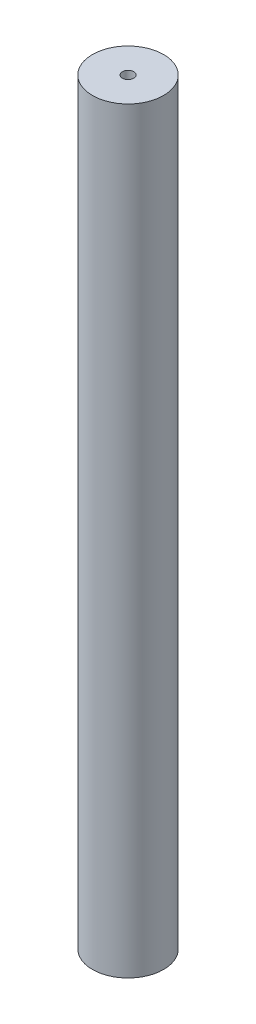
ISO-10303-21;
HEADER;
FILE_DESCRIPTION(('STEP AP214'),'2;1');
FILE_NAME('part.step','',(''),(''),'','','');
FILE_SCHEMA(('AUTOMOTIVE_DESIGN { 1 0 10303 214 1 1 1 1 }'));
ENDSEC;
DATA;
#1=APPLICATION_CONTEXT('core data for automotive mechanical design processes');
#2=APPLICATION_PROTOCOL_DEFINITION('international standard','automotive_design',2000,#1);
#3=PRODUCT_CONTEXT('',#1,'mechanical');
#4=PRODUCT('Part','Part','',(#3));
#5=PRODUCT_RELATED_PRODUCT_CATEGORY('part','',(#4));
#6=PRODUCT_DEFINITION_FORMATION('','',#4);
#7=PRODUCT_DEFINITION_CONTEXT('part definition',#1,'design');
#8=PRODUCT_DEFINITION('design','',#6,#7);
#9=PRODUCT_DEFINITION_SHAPE('','',#8);
#10=(LENGTH_UNIT() NAMED_UNIT(*) SI_UNIT(.MILLI.,.METRE.));
#11=(NAMED_UNIT(*) PLANE_ANGLE_UNIT() SI_UNIT($,.RADIAN.));
#12=(NAMED_UNIT(*) SI_UNIT($,.STERADIAN.) SOLID_ANGLE_UNIT());
#13=UNCERTAINTY_MEASURE_WITH_UNIT(LENGTH_MEASURE(1.E-05),#10,'distance_accuracy_value','');
#14=(GEOMETRIC_REPRESENTATION_CONTEXT(3) GLOBAL_UNCERTAINTY_ASSIGNED_CONTEXT((#13)) GLOBAL_UNIT_ASSIGNED_CONTEXT((#10,
#11,#12)) REPRESENTATION_CONTEXT('',''));
#15=CARTESIAN_POINT('',(0.,0.,0.));
#16=DIRECTION('',(0.,0.,1.));
#17=DIRECTION('',(1.,0.,0.));
#18=AXIS2_PLACEMENT_3D('',#15,#16,#17);
#19=CARTESIAN_POINT('',(175.,7.,0.));
#20=DIRECTION('',(0.,1.,0.));
#21=DIRECTION('',(0.,0.,1.));
#22=AXIS2_PLACEMENT_3D('',#19,#20,#21);
#23=PLANE('',#22);
#24=CARTESIAN_POINT('',(175.,7.,0.));
#25=DIRECTION('',(0.,1.,0.));
#26=DIRECTION('',(0.,0.,1.));
#27=AXIS2_PLACEMENT_3D('',#24,#25,#26);
#28=CIRCLE('',#27,1.59999999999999);
#29=CARTESIAN_POINT('',(175.,7.,1.59999999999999));
#30=VERTEX_POINT('',#29);
#31=EDGE_CURVE('E54',#30,#30,#28,.T.);
#32=ORIENTED_EDGE('',*,*,#31,.T.);
#33=EDGE_LOOP('',(#32));
#34=FACE_BOUND('',#33,.T.);
#35=CARTESIAN_POINT('',(175.,7.00000000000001,0.));
#36=DIRECTION('',(0.,1.,0.));
#37=DIRECTION('',(0.,0.,1.));
#38=AXIS2_PLACEMENT_3D('',#35,#36,#37);
#39=CIRCLE('',#38,10.);
#40=CARTESIAN_POINT('',(175.,7.00000000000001,10.));
#41=VERTEX_POINT('',#40);
#42=EDGE_CURVE('E43',#41,#41,#39,.T.);
#43=ORIENTED_EDGE('',*,*,#42,.F.);
#44=EDGE_LOOP('',(#43));
#45=FACE_BOUND('',#44,.T.);
#46=ADVANCED_FACE('F35',(#34,#45),#23,.F.);
#47=CARTESIAN_POINT('',(175.,248.284271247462,0.));
#48=DIRECTION('',(0.,-1.,0.));
#49=DIRECTION('',(0.,0.,-1.));
#50=AXIS2_PLACEMENT_3D('',#47,#48,#49);
#51=CYLINDRICAL_SURFACE('',#50,10.);
#52=CARTESIAN_POINT('',(175.,220.,0.));
#53=DIRECTION('',(0.,-1.,0.));
#54=DIRECTION('',(0.,0.,-1.));
#55=AXIS2_PLACEMENT_3D('',#52,#53,#54);
#56=CIRCLE('',#55,10.);
#57=CARTESIAN_POINT('',(175.,220.,-10.));
#58=VERTEX_POINT('',#57);
#59=EDGE_CURVE('E12',#58,#58,#56,.T.);
#60=ORIENTED_EDGE('',*,*,#59,.T.);
#61=EDGE_LOOP('',(#60));
#62=FACE_BOUND('',#61,.T.);
#63=ORIENTED_EDGE('',*,*,#42,.T.);
#64=EDGE_LOOP('',(#63));
#65=FACE_BOUND('',#64,.T.);
#66=ADVANCED_FACE('F68',(#62,#65),#51,.T.);
#67=CARTESIAN_POINT('',(0.,220.,0.));
#68=DIRECTION('',(0.,-1.,0.));
#69=DIRECTION('',(0.,0.,-1.));
#70=AXIS2_PLACEMENT_3D('',#67,#68,#69);
#71=PLANE('',#70);
#72=CARTESIAN_POINT('',(175.,220.,0.));
#73=DIRECTION('',(0.,-1.,0.));
#74=DIRECTION('',(0.,0.,-1.));
#75=AXIS2_PLACEMENT_3D('',#72,#73,#74);
#76=CIRCLE('',#75,1.59999999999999);
#77=CARTESIAN_POINT('',(175.,220.,-1.59999999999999));
#78=VERTEX_POINT('',#77);
#79=EDGE_CURVE('E55',#78,#78,#76,.T.);
#80=ORIENTED_EDGE('',*,*,#79,.T.);
#81=EDGE_LOOP('',(#80));
#82=FACE_BOUND('',#81,.T.);
#83=ORIENTED_EDGE('',*,*,#59,.F.);
#84=EDGE_LOOP('',(#83));
#85=FACE_BOUND('',#84,.T.);
#86=ADVANCED_FACE('F75',(#82,#85),#71,.F.);
#87=CARTESIAN_POINT('',(175.,0.,0.));
#88=DIRECTION('',(0.,-1.,0.));
#89=DIRECTION('',(0.,0.,-1.));
#90=AXIS2_PLACEMENT_3D('',#87,#88,#89);
#91=CYLINDRICAL_SURFACE('',#90,1.59999999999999);
#92=CARTESIAN_POINT('',(175.,21.1666333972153,0.));
#93=DIRECTION('',(0.,-1.,0.));
#94=DIRECTION('',(0.,0.,-1.));
#95=AXIS2_PLACEMENT_3D('',#92,#93,#94);
#96=CIRCLE('',#95,1.59999999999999);
#97=CARTESIAN_POINT('',(175.,21.1666333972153,-1.59999999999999));
#98=VERTEX_POINT('',#97);
#99=EDGE_CURVE('E39',#98,#98,#96,.T.);
#100=ORIENTED_EDGE('',*,*,#99,.F.);
#101=EDGE_LOOP('',(#100));
#102=FACE_BOUND('',#101,.T.);
#103=ORIENTED_EDGE('',*,*,#31,.F.);
#104=EDGE_LOOP('',(#103));
#105=FACE_BOUND('',#104,.T.);
#106=ADVANCED_FACE('F50',(#102,#105),#91,.F.);
#107=CARTESIAN_POINT('',(175.,20.8571673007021,0.));
#108=DIRECTION('',(0.,-1.,0.));
#109=DIRECTION('',(0.,0.,-1.));
#110=AXIS2_PLACEMENT_3D('',#107,#108,#109);
#111=CONICAL_SURFACE('',#110,2.11503807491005,1.02974425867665);
#112=CARTESIAN_POINT('',(175.,22.1280103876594,0.));
#113=VERTEX_POINT('',#112);
#114=VERTEX_LOOP('',#113);
#115=FACE_BOUND('',#114,.T.);
#116=ORIENTED_EDGE('',*,*,#99,.T.);
#117=EDGE_LOOP('',(#116));
#118=FACE_BOUND('',#117,.T.);
#119=ADVANCED_FACE('F37',(#115,#118),#111,.F.);
#120=CARTESIAN_POINT('',(175.,239.5,0.));
#121=DIRECTION('',(0.,1.,0.));
#122=DIRECTION('',(0.,0.,1.));
#123=AXIS2_PLACEMENT_3D('',#120,#121,#122);
#124=CYLINDRICAL_SURFACE('',#123,1.59999999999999);
#125=CARTESIAN_POINT('',(175.,209.5,0.));
#126=DIRECTION('',(0.,1.,0.));
#127=DIRECTION('',(0.,0.,1.));
#128=AXIS2_PLACEMENT_3D('',#125,#126,#127);
#129=CIRCLE('',#128,1.59999999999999);
#130=CARTESIAN_POINT('',(175.,209.5,1.59999999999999));
#131=VERTEX_POINT('',#130);
#132=EDGE_CURVE('E59',#131,#131,#129,.T.);
#133=ORIENTED_EDGE('',*,*,#132,.F.);
#134=EDGE_LOOP('',(#133));
#135=FACE_BOUND('',#134,.T.);
#136=ORIENTED_EDGE('',*,*,#79,.F.);
#137=EDGE_LOOP('',(#136));
#138=FACE_BOUND('',#137,.T.);
#139=ADVANCED_FACE('F49',(#135,#138),#124,.F.);
#140=CARTESIAN_POINT('',(175.,209.5,0.));
#141=DIRECTION('',(0.,-1.,0.));
#142=DIRECTION('',(0.,0.,-1.));
#143=AXIS2_PLACEMENT_3D('',#140,#141,#142);
#144=PLANE('',#143);
#145=ORIENTED_EDGE('',*,*,#132,.T.);
#146=EDGE_LOOP('',(#145));
#147=FACE_BOUND('',#146,.T.);
#148=ADVANCED_FACE('F83',(#147),#144,.F.);
#149=CLOSED_SHELL('',(#46,#66,#86,#106,#119,#139,#148));
#150=MANIFOLD_SOLID_BREP('B2',#149);
#151=ADVANCED_BREP_SHAPE_REPRESENTATION('',(#18,#150),#14);
#152=SHAPE_DEFINITION_REPRESENTATION(#9,#151);
ENDSEC;
END-ISO-10303-21;
